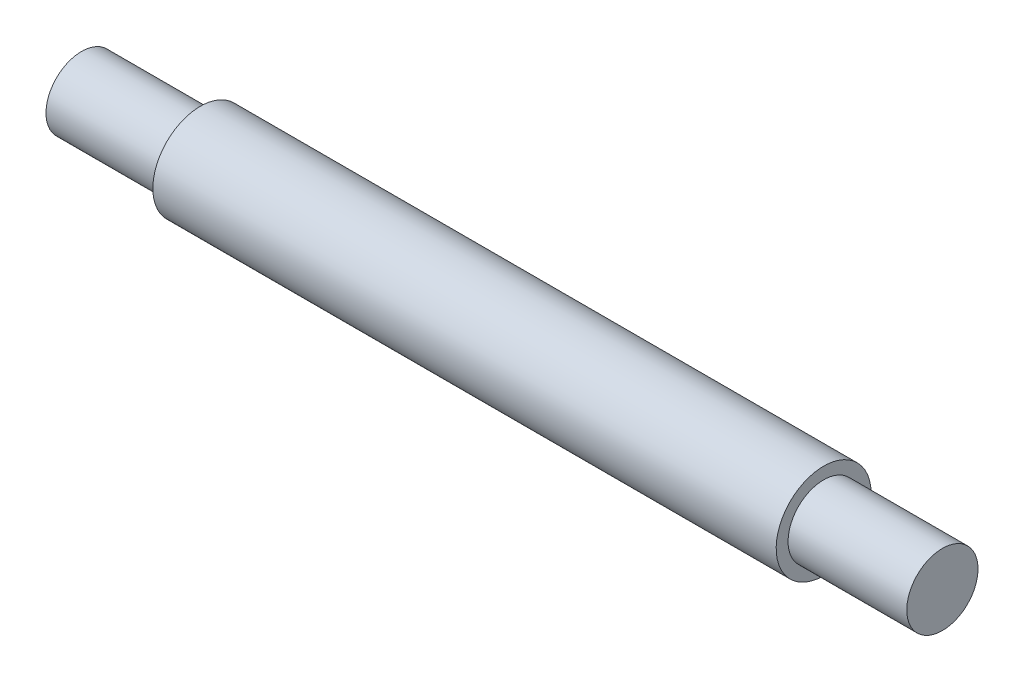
from build123d import *


with BuildPart() as part:
    # Esquisse1 → R_volution1 (revolve)
    with BuildSketch(Plane.XY, mode=Mode.PRIVATE) as r_volution1_sk:
        Polygon((-36.25, 0), (36.25, 0), (36.25, 3), (26.25, 3), (26.25, 4), (-26.25, 4), (-26.25, 3), (-36.25, 3), align=None)
    revolve(r_volution1_sk.sketch.rotate(Axis((-36.25, 0, 0), (1, 0, 0)), 180), axis=Axis((-36.25, 0, 0), (1, 0, 0)))


solid = part.part
